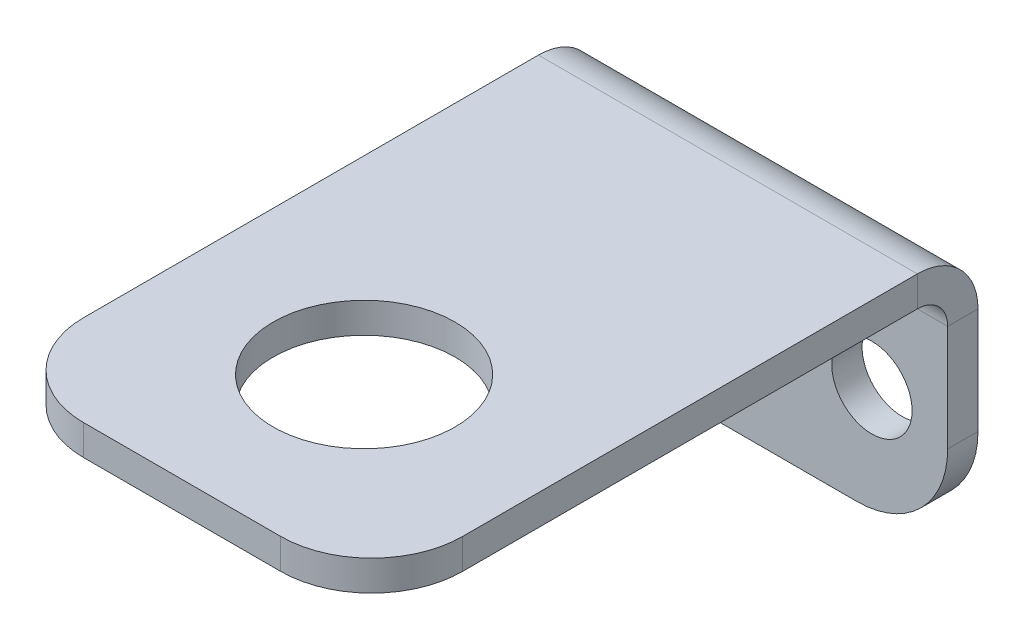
ISO-10303-21;
HEADER;
FILE_DESCRIPTION(('STEP AP214'),'2;1');
FILE_NAME('part.step','',(''),(''),'','','');
FILE_SCHEMA(('AUTOMOTIVE_DESIGN { 1 0 10303 214 1 1 1 1 }'));
ENDSEC;
DATA;
#1=APPLICATION_CONTEXT('core data for automotive mechanical design processes');
#2=APPLICATION_PROTOCOL_DEFINITION('international standard','automotive_design',2000,#1);
#3=PRODUCT_CONTEXT('',#1,'mechanical');
#4=PRODUCT('Part','Part','',(#3));
#5=PRODUCT_RELATED_PRODUCT_CATEGORY('part','',(#4));
#6=PRODUCT_DEFINITION_FORMATION('','',#4);
#7=PRODUCT_DEFINITION_CONTEXT('part definition',#1,'design');
#8=PRODUCT_DEFINITION('design','',#6,#7);
#9=PRODUCT_DEFINITION_SHAPE('','',#8);
#10=(LENGTH_UNIT() NAMED_UNIT(*) SI_UNIT(.MILLI.,.METRE.));
#11=(NAMED_UNIT(*) PLANE_ANGLE_UNIT() SI_UNIT($,.RADIAN.));
#12=(NAMED_UNIT(*) SI_UNIT($,.STERADIAN.) SOLID_ANGLE_UNIT());
#13=UNCERTAINTY_MEASURE_WITH_UNIT(LENGTH_MEASURE(1.E-05),#10,'distance_accuracy_value','');
#14=(GEOMETRIC_REPRESENTATION_CONTEXT(3) GLOBAL_UNCERTAINTY_ASSIGNED_CONTEXT((#13)) GLOBAL_UNIT_ASSIGNED_CONTEXT((#10,
#11,#12)) REPRESENTATION_CONTEXT('',''));
#15=CARTESIAN_POINT('',(0.,0.,0.));
#16=DIRECTION('',(0.,0.,1.));
#17=DIRECTION('',(1.,0.,0.));
#18=AXIS2_PLACEMENT_3D('',#15,#16,#17);
#19=CARTESIAN_POINT('',(0.,0.,2.));
#20=DIRECTION('',(1.,0.,0.));
#21=DIRECTION('',(0.,0.,-1.));
#22=AXIS2_PLACEMENT_3D('',#19,#20,#21);
#23=PLANE('',#22);
#24=DIRECTION('',(0.,-1.,0.));
#25=VECTOR('',#24,1.);
#26=CARTESIAN_POINT('',(0.,0.,0.));
#27=LINE('',#26,#25);
#28=CARTESIAN_POINT('',(0.,13.,0.));
#29=VERTEX_POINT('',#28);
#30=CARTESIAN_POINT('',(0.,6.,0.));
#31=VERTEX_POINT('',#30);
#32=EDGE_CURVE('E188',#29,#31,#27,.T.);
#33=ORIENTED_EDGE('',*,*,#32,.T.);
#34=DIRECTION('',(0.,0.,-1.));
#35=VECTOR('',#34,1.);
#36=CARTESIAN_POINT('',(0.,6.,2.));
#37=LINE('',#36,#35);
#38=CARTESIAN_POINT('',(0.,6.,2.));
#39=VERTEX_POINT('',#38);
#40=EDGE_CURVE('E57',#31,#39,#37,.F.);
#41=ORIENTED_EDGE('',*,*,#40,.T.);
#42=DIRECTION('',(0.,-1.,0.));
#43=VECTOR('',#42,1.);
#44=CARTESIAN_POINT('',(0.,0.,2.));
#45=LINE('',#44,#43);
#46=CARTESIAN_POINT('',(0.,13.,2.));
#47=VERTEX_POINT('',#46);
#48=EDGE_CURVE('E190',#47,#39,#45,.T.);
#49=ORIENTED_EDGE('',*,*,#48,.F.);
#50=DIRECTION('',(0.,0.,-1.));
#51=VECTOR('',#50,1.);
#52=CARTESIAN_POINT('',(0.,13.,2.));
#53=LINE('',#52,#51);
#54=EDGE_CURVE('E177',#47,#29,#53,.T.);
#55=ORIENTED_EDGE('',*,*,#54,.T.);
#56=EDGE_LOOP('',(#33,#41,#49,#55));
#57=FACE_BOUND('',#56,.T.);
#58=ADVANCED_FACE('F34',(#57),#23,.F.);
#59=CARTESIAN_POINT('',(25.,0.,2.));
#60=DIRECTION('',(-1.,0.,0.));
#61=DIRECTION('',(0.,-1.,0.));
#62=AXIS2_PLACEMENT_3D('',#59,#60,#61);
#63=PLANE('',#62);
#64=DIRECTION('',(0.,1.,0.));
#65=VECTOR('',#64,1.);
#66=CARTESIAN_POINT('',(25.,0.,2.));
#67=LINE('',#66,#65);
#68=CARTESIAN_POINT('',(25.,6.,2.));
#69=VERTEX_POINT('',#68);
#70=CARTESIAN_POINT('',(25.,13.,2.));
#71=VERTEX_POINT('',#70);
#72=EDGE_CURVE('E195',#69,#71,#67,.T.);
#73=ORIENTED_EDGE('',*,*,#72,.F.);
#74=DIRECTION('',(0.,0.,-1.));
#75=VECTOR('',#74,1.);
#76=CARTESIAN_POINT('',(25.,6.,2.));
#77=LINE('',#76,#75);
#78=CARTESIAN_POINT('',(25.,6.,0.));
#79=VERTEX_POINT('',#78);
#80=EDGE_CURVE('E11',#69,#79,#77,.T.);
#81=ORIENTED_EDGE('',*,*,#80,.T.);
#82=DIRECTION('',(0.,1.,0.));
#83=VECTOR('',#82,1.);
#84=CARTESIAN_POINT('',(25.,0.,0.));
#85=LINE('',#84,#83);
#86=CARTESIAN_POINT('',(25.,13.,0.));
#87=VERTEX_POINT('',#86);
#88=EDGE_CURVE('E193',#79,#87,#85,.T.);
#89=ORIENTED_EDGE('',*,*,#88,.T.);
#90=DIRECTION('',(0.,0.,-1.));
#91=VECTOR('',#90,1.);
#92=CARTESIAN_POINT('',(25.,13.,2.));
#93=LINE('',#92,#91);
#94=EDGE_CURVE('E185',#71,#87,#93,.T.);
#95=ORIENTED_EDGE('',*,*,#94,.F.);
#96=EDGE_LOOP('',(#73,#81,#89,#95));
#97=FACE_BOUND('',#96,.T.);
#98=ADVANCED_FACE('F250',(#97),#63,.F.);
#99=CARTESIAN_POINT('',(0.,15.,2.));
#100=DIRECTION('',(0.,0.,-1.));
#101=DIRECTION('',(-1.,0.,0.));
#102=AXIS2_PLACEMENT_3D('',#99,#100,#101);
#103=PLANE('',#102);
#104=CARTESIAN_POINT('',(20.,7.,2.));
#105=DIRECTION('',(0.,0.,1.));
#106=DIRECTION('',(1.,0.,0.));
#107=AXIS2_PLACEMENT_3D('',#104,#105,#106);
#108=CIRCLE('',#107,2.65);
#109=CARTESIAN_POINT('',(22.65,7.,2.));
#110=VERTEX_POINT('',#109);
#111=EDGE_CURVE('E278',#110,#110,#108,.T.);
#112=ORIENTED_EDGE('',*,*,#111,.F.);
#113=EDGE_LOOP('',(#112));
#114=FACE_BOUND('',#113,.T.);
#115=CARTESIAN_POINT('',(5.,7.,2.));
#116=DIRECTION('',(0.,0.,1.));
#117=DIRECTION('',(1.,0.,0.));
#118=AXIS2_PLACEMENT_3D('',#115,#116,#117);
#119=CIRCLE('',#118,2.65);
#120=CARTESIAN_POINT('',(7.65,7.,2.));
#121=VERTEX_POINT('',#120);
#122=EDGE_CURVE('E272',#121,#121,#119,.T.);
#123=ORIENTED_EDGE('',*,*,#122,.F.);
#124=EDGE_LOOP('',(#123));
#125=FACE_BOUND('',#124,.T.);
#126=ORIENTED_EDGE('',*,*,#48,.T.);
#127=CARTESIAN_POINT('',(6.,6.,2.));
#128=DIRECTION('',(0.,0.,-1.));
#129=DIRECTION('',(-1.,0.,0.));
#130=AXIS2_PLACEMENT_3D('',#127,#128,#129);
#131=CIRCLE('',#130,6.);
#132=CARTESIAN_POINT('',(6.,0.,2.));
#133=VERTEX_POINT('',#132);
#134=EDGE_CURVE('E42',#39,#133,#131,.F.);
#135=ORIENTED_EDGE('',*,*,#134,.T.);
#136=DIRECTION('',(1.,0.,0.));
#137=VECTOR('',#136,1.);
#138=CARTESIAN_POINT('',(0.,0.,2.));
#139=LINE('',#138,#137);
#140=CARTESIAN_POINT('',(19.,0.,2.));
#141=VERTEX_POINT('',#140);
#142=EDGE_CURVE('E192',#133,#141,#139,.T.);
#143=ORIENTED_EDGE('',*,*,#142,.T.);
#144=CARTESIAN_POINT('',(19.,6.,2.));
#145=DIRECTION('',(0.,0.,-1.));
#146=DIRECTION('',(-1.,0.,0.));
#147=AXIS2_PLACEMENT_3D('',#144,#145,#146);
#148=CIRCLE('',#147,6.);
#149=EDGE_CURVE('E49',#141,#69,#148,.F.);
#150=ORIENTED_EDGE('',*,*,#149,.T.);
#151=ORIENTED_EDGE('',*,*,#72,.T.);
#152=DIRECTION('',(-1.,0.,0.));
#153=VECTOR('',#152,1.);
#154=CARTESIAN_POINT('',(0.,13.,2.));
#155=LINE('',#154,#153);
#156=EDGE_CURVE('E181',#47,#71,#155,.F.);
#157=ORIENTED_EDGE('',*,*,#156,.F.);
#158=EDGE_LOOP('',(#126,#135,#143,#150,#151,#157));
#159=FACE_BOUND('',#158,.T.);
#160=ADVANCED_FACE('F231',(#114,#125,#159),#103,.F.);
#161=CARTESIAN_POINT('',(0.,15.,0.));
#162=DIRECTION('',(0.,0.,-1.));
#163=DIRECTION('',(-1.,0.,0.));
#164=AXIS2_PLACEMENT_3D('',#161,#162,#163);
#165=PLANE('',#164);
#166=CARTESIAN_POINT('',(20.,7.,0.));
#167=DIRECTION('',(0.,0.,1.));
#168=DIRECTION('',(1.,0.,0.));
#169=AXIS2_PLACEMENT_3D('',#166,#167,#168);
#170=CIRCLE('',#169,2.65);
#171=CARTESIAN_POINT('',(22.65,7.,0.));
#172=VERTEX_POINT('',#171);
#173=EDGE_CURVE('E275',#172,#172,#170,.T.);
#174=ORIENTED_EDGE('',*,*,#173,.T.);
#175=EDGE_LOOP('',(#174));
#176=FACE_BOUND('',#175,.T.);
#177=CARTESIAN_POINT('',(5.,7.,0.));
#178=DIRECTION('',(0.,0.,1.));
#179=DIRECTION('',(1.,0.,0.));
#180=AXIS2_PLACEMENT_3D('',#177,#178,#179);
#181=CIRCLE('',#180,2.65);
#182=CARTESIAN_POINT('',(7.65,7.,0.));
#183=VERTEX_POINT('',#182);
#184=EDGE_CURVE('E269',#183,#183,#181,.T.);
#185=ORIENTED_EDGE('',*,*,#184,.T.);
#186=EDGE_LOOP('',(#185));
#187=FACE_BOUND('',#186,.T.);
#188=DIRECTION('',(1.,0.,0.));
#189=VECTOR('',#188,1.);
#190=CARTESIAN_POINT('',(0.,0.,0.));
#191=LINE('',#190,#189);
#192=CARTESIAN_POINT('',(6.,0.,0.));
#193=VERTEX_POINT('',#192);
#194=CARTESIAN_POINT('',(19.,0.,0.));
#195=VERTEX_POINT('',#194);
#196=EDGE_CURVE('E199',#193,#195,#191,.T.);
#197=ORIENTED_EDGE('',*,*,#196,.F.);
#198=CARTESIAN_POINT('',(6.,6.,0.));
#199=DIRECTION('',(0.,0.,-1.));
#200=DIRECTION('',(-1.,0.,0.));
#201=AXIS2_PLACEMENT_3D('',#198,#199,#200);
#202=CIRCLE('',#201,6.);
#203=EDGE_CURVE('E226',#193,#31,#202,.T.);
#204=ORIENTED_EDGE('',*,*,#203,.T.);
#205=ORIENTED_EDGE('',*,*,#32,.F.);
#206=DIRECTION('',(-1.,0.,0.));
#207=VECTOR('',#206,1.);
#208=CARTESIAN_POINT('',(0.,13.,0.));
#209=LINE('',#208,#207);
#210=EDGE_CURVE('E134',#29,#87,#209,.F.);
#211=ORIENTED_EDGE('',*,*,#210,.T.);
#212=ORIENTED_EDGE('',*,*,#88,.F.);
#213=CARTESIAN_POINT('',(19.,6.,0.));
#214=DIRECTION('',(0.,0.,-1.));
#215=DIRECTION('',(-1.,0.,0.));
#216=AXIS2_PLACEMENT_3D('',#213,#214,#215);
#217=CIRCLE('',#216,6.);
#218=EDGE_CURVE('E224',#79,#195,#217,.T.);
#219=ORIENTED_EDGE('',*,*,#218,.T.);
#220=EDGE_LOOP('',(#197,#204,#205,#211,#212,#219));
#221=FACE_BOUND('',#220,.T.);
#222=ADVANCED_FACE('F242',(#176,#187,#221),#165,.T.);
#223=CARTESIAN_POINT('',(0.,0.,2.));
#224=DIRECTION('',(0.,1.,0.));
#225=DIRECTION('',(0.,0.,1.));
#226=AXIS2_PLACEMENT_3D('',#223,#224,#225);
#227=PLANE('',#226);
#228=ORIENTED_EDGE('',*,*,#142,.F.);
#229=DIRECTION('',(0.,0.,-1.));
#230=VECTOR('',#229,1.);
#231=CARTESIAN_POINT('',(6.,0.,2.));
#232=LINE('',#231,#230);
#233=EDGE_CURVE('E221',#133,#193,#232,.T.);
#234=ORIENTED_EDGE('',*,*,#233,.T.);
#235=ORIENTED_EDGE('',*,*,#196,.T.);
#236=DIRECTION('',(0.,0.,-1.));
#237=VECTOR('',#236,1.);
#238=CARTESIAN_POINT('',(19.,0.,2.));
#239=LINE('',#238,#237);
#240=EDGE_CURVE('E219',#195,#141,#239,.F.);
#241=ORIENTED_EDGE('',*,*,#240,.T.);
#242=EDGE_LOOP('',(#228,#234,#235,#241));
#243=FACE_BOUND('',#242,.T.);
#244=ADVANCED_FACE('F236',(#243),#227,.F.);
#245=CARTESIAN_POINT('',(25.,13.,4.));
#246=DIRECTION('',(1.,0.,0.));
#247=DIRECTION('',(0.,0.,-1.));
#248=AXIS2_PLACEMENT_3D('',#245,#246,#247);
#249=PLANE('',#248);
#250=DIRECTION('',(0.,1.,0.));
#251=VECTOR('',#250,1.);
#252=CARTESIAN_POINT('',(25.,15.,3.99999999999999));
#253=LINE('',#252,#251);
#254=CARTESIAN_POINT('',(25.,15.,3.99999999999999));
#255=VERTEX_POINT('',#254);
#256=CARTESIAN_POINT('',(25.,17.,3.99999999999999));
#257=VERTEX_POINT('',#256);
#258=EDGE_CURVE('E257',#255,#257,#253,.T.);
#259=ORIENTED_EDGE('',*,*,#258,.F.);
#260=CARTESIAN_POINT('',(25.,13.,4.));
#261=DIRECTION('',(-1.,0.,0.));
#262=DIRECTION('',(0.,0.,1.));
#263=AXIS2_PLACEMENT_3D('',#260,#261,#262);
#264=CIRCLE('',#263,2.);
#265=EDGE_CURVE('E137',#71,#255,#264,.F.);
#266=ORIENTED_EDGE('',*,*,#265,.F.);
#267=ORIENTED_EDGE('',*,*,#94,.T.);
#268=CARTESIAN_POINT('',(25.,13.,4.));
#269=DIRECTION('',(-1.,0.,0.));
#270=DIRECTION('',(0.,0.,1.));
#271=AXIS2_PLACEMENT_3D('',#268,#269,#270);
#272=CIRCLE('',#271,4.);
#273=EDGE_CURVE('E176',#87,#257,#272,.F.);
#274=ORIENTED_EDGE('',*,*,#273,.T.);
#275=EDGE_LOOP('',(#259,#266,#267,#274));
#276=FACE_BOUND('',#275,.T.);
#277=ADVANCED_FACE('F256',(#276),#249,.T.);
#278=CARTESIAN_POINT('',(0.,13.,4.));
#279=DIRECTION('',(1.,0.,0.));
#280=DIRECTION('',(0.,0.,-1.));
#281=AXIS2_PLACEMENT_3D('',#278,#279,#280);
#282=PLANE('',#281);
#283=CARTESIAN_POINT('',(0.,13.,4.));
#284=DIRECTION('',(-1.,0.,0.));
#285=DIRECTION('',(0.,0.,1.));
#286=AXIS2_PLACEMENT_3D('',#283,#284,#285);
#287=CIRCLE('',#286,2.);
#288=CARTESIAN_POINT('',(0.,15.,3.99999999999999));
#289=VERTEX_POINT('',#288);
#290=EDGE_CURVE('E144',#289,#47,#287,.T.);
#291=ORIENTED_EDGE('',*,*,#290,.F.);
#292=DIRECTION('',(0.,1.,0.));
#293=VECTOR('',#292,1.);
#294=CARTESIAN_POINT('',(0.,15.,3.99999999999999));
#295=LINE('',#294,#293);
#296=CARTESIAN_POINT('',(0.,17.,3.99999999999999));
#297=VERTEX_POINT('',#296);
#298=EDGE_CURVE('E141',#289,#297,#295,.T.);
#299=ORIENTED_EDGE('',*,*,#298,.T.);
#300=CARTESIAN_POINT('',(0.,13.,4.));
#301=DIRECTION('',(-1.,0.,0.));
#302=DIRECTION('',(0.,0.,1.));
#303=AXIS2_PLACEMENT_3D('',#300,#301,#302);
#304=CIRCLE('',#303,4.);
#305=EDGE_CURVE('E126',#297,#29,#304,.T.);
#306=ORIENTED_EDGE('',*,*,#305,.T.);
#307=ORIENTED_EDGE('',*,*,#54,.F.);
#308=EDGE_LOOP('',(#291,#299,#306,#307));
#309=FACE_BOUND('',#308,.T.);
#310=ADVANCED_FACE('F142',(#309),#282,.F.);
#311=CARTESIAN_POINT('',(0.,13.,4.));
#312=DIRECTION('',(-1.,0.,0.));
#313=DIRECTION('',(0.,1.,0.));
#314=AXIS2_PLACEMENT_3D('',#311,#312,#313);
#315=CYLINDRICAL_SURFACE('',#314,4.);
#316=ORIENTED_EDGE('',*,*,#210,.F.);
#317=ORIENTED_EDGE('',*,*,#305,.F.);
#318=DIRECTION('',(1.,0.,0.));
#319=VECTOR('',#318,1.);
#320=CARTESIAN_POINT('',(25.,17.,3.99999999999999));
#321=LINE('',#320,#319);
#322=EDGE_CURVE('E131',#297,#257,#321,.T.);
#323=ORIENTED_EDGE('',*,*,#322,.T.);
#324=ORIENTED_EDGE('',*,*,#273,.F.);
#325=EDGE_LOOP('',(#316,#317,#323,#324));
#326=FACE_BOUND('',#325,.T.);
#327=ADVANCED_FACE('F128',(#326),#315,.T.);
#328=CARTESIAN_POINT('',(0.,13.,4.));
#329=DIRECTION('',(-1.,0.,0.));
#330=DIRECTION('',(0.,1.,0.));
#331=AXIS2_PLACEMENT_3D('',#328,#329,#330);
#332=CYLINDRICAL_SURFACE('',#331,2.);
#333=ORIENTED_EDGE('',*,*,#156,.T.);
#334=ORIENTED_EDGE('',*,*,#265,.T.);
#335=DIRECTION('',(-1.,0.,0.));
#336=VECTOR('',#335,1.);
#337=CARTESIAN_POINT('',(25.,15.,3.99999999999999));
#338=LINE('',#337,#336);
#339=EDGE_CURVE('E149',#255,#289,#338,.T.);
#340=ORIENTED_EDGE('',*,*,#339,.T.);
#341=ORIENTED_EDGE('',*,*,#290,.T.);
#342=EDGE_LOOP('',(#333,#334,#340,#341));
#343=FACE_BOUND('',#342,.T.);
#344=ADVANCED_FACE('F244',(#343),#332,.F.);
#345=CARTESIAN_POINT('',(25.,17.,1.99999999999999));
#346=DIRECTION('',(-1.,0.,0.));
#347=DIRECTION('',(0.,0.,1.));
#348=AXIS2_PLACEMENT_3D('',#345,#346,#347);
#349=PLANE('',#348);
#350=DIRECTION('',(0.,0.,-1.));
#351=VECTOR('',#350,1.);
#352=CARTESIAN_POINT('',(25.,17.,1.99999999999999));
#353=LINE('',#352,#351);
#354=CARTESIAN_POINT('',(25.,17.0000000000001,34.));
#355=VERTEX_POINT('',#354);
#356=EDGE_CURVE('E157',#355,#257,#353,.T.);
#357=ORIENTED_EDGE('',*,*,#356,.F.);
#358=DIRECTION('',(0.,-1.,0.));
#359=VECTOR('',#358,1.);
#360=CARTESIAN_POINT('',(25.,17.0000000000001,34.));
#361=LINE('',#360,#359);
#362=CARTESIAN_POINT('',(25.,15.0000000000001,34.));
#363=VERTEX_POINT('',#362);
#364=EDGE_CURVE('E216',#355,#363,#361,.T.);
#365=ORIENTED_EDGE('',*,*,#364,.T.);
#366=DIRECTION('',(0.,0.,-1.));
#367=VECTOR('',#366,1.);
#368=CARTESIAN_POINT('',(25.,15.,2.));
#369=LINE('',#368,#367);
#370=EDGE_CURVE('E158',#363,#255,#369,.T.);
#371=ORIENTED_EDGE('',*,*,#370,.T.);
#372=ORIENTED_EDGE('',*,*,#258,.T.);
#373=EDGE_LOOP('',(#357,#365,#371,#372));
#374=FACE_BOUND('',#373,.T.);
#375=ADVANCED_FACE('F421',(#374),#349,.F.);
#376=CARTESIAN_POINT('',(0.,17.0000000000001,40.));
#377=DIRECTION('',(1.,0.,0.));
#378=DIRECTION('',(0.,0.,-1.));
#379=AXIS2_PLACEMENT_3D('',#376,#377,#378);
#380=PLANE('',#379);
#381=DIRECTION('',(0.,0.,1.));
#382=VECTOR('',#381,1.);
#383=CARTESIAN_POINT('',(0.,15.0000000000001,40.));
#384=LINE('',#383,#382);
#385=CARTESIAN_POINT('',(0.,15.0000000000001,34.));
#386=VERTEX_POINT('',#385);
#387=EDGE_CURVE('E171',#289,#386,#384,.T.);
#388=ORIENTED_EDGE('',*,*,#387,.T.);
#389=DIRECTION('',(0.,-1.,0.));
#390=VECTOR('',#389,1.);
#391=CARTESIAN_POINT('',(0.,17.0000000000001,34.));
#392=LINE('',#391,#390);
#393=CARTESIAN_POINT('',(0.,17.0000000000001,34.));
#394=VERTEX_POINT('',#393);
#395=EDGE_CURVE('E162',#386,#394,#392,.F.);
#396=ORIENTED_EDGE('',*,*,#395,.T.);
#397=DIRECTION('',(0.,0.,1.));
#398=VECTOR('',#397,1.);
#399=CARTESIAN_POINT('',(0.,17.0000000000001,40.));
#400=LINE('',#399,#398);
#401=EDGE_CURVE('E154',#297,#394,#400,.T.);
#402=ORIENTED_EDGE('',*,*,#401,.F.);
#403=ORIENTED_EDGE('',*,*,#298,.F.);
#404=EDGE_LOOP('',(#388,#396,#402,#403));
#405=FACE_BOUND('',#404,.T.);
#406=ADVANCED_FACE('F160',(#405),#380,.F.);
#407=CARTESIAN_POINT('',(25.,17.0000000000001,40.));
#408=DIRECTION('',(0.,-1.,0.));
#409=DIRECTION('',(0.,0.,-1.));
#410=AXIS2_PLACEMENT_3D('',#407,#408,#409);
#411=PLANE('',#410);
#412=CARTESIAN_POINT('',(12.5,17.0000000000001,28.));
#413=DIRECTION('',(0.,-1.,0.));
#414=DIRECTION('',(0.,0.,-1.));
#415=AXIS2_PLACEMENT_3D('',#412,#413,#414);
#416=CIRCLE('',#415,6.);
#417=CARTESIAN_POINT('',(12.5,17.0000000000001,22.));
#418=VERTEX_POINT('',#417);
#419=EDGE_CURVE('E263',#418,#418,#416,.T.);
#420=ORIENTED_EDGE('',*,*,#419,.T.);
#421=EDGE_LOOP('',(#420));
#422=FACE_BOUND('',#421,.T.);
#423=ORIENTED_EDGE('',*,*,#401,.T.);
#424=CARTESIAN_POINT('',(6.00000000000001,17.0000000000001,34.));
#425=DIRECTION('',(0.,-1.,0.));
#426=DIRECTION('',(0.,0.,-1.));
#427=AXIS2_PLACEMENT_3D('',#424,#425,#426);
#428=CIRCLE('',#427,6.);
#429=CARTESIAN_POINT('',(6.00000000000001,17.0000000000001,40.));
#430=VERTEX_POINT('',#429);
#431=EDGE_CURVE('E214',#394,#430,#428,.F.);
#432=ORIENTED_EDGE('',*,*,#431,.T.);
#433=DIRECTION('',(1.,0.,0.));
#434=VECTOR('',#433,1.);
#435=CARTESIAN_POINT('',(25.,17.0000000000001,40.));
#436=LINE('',#435,#434);
#437=CARTESIAN_POINT('',(19.,17.0000000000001,40.));
#438=VERTEX_POINT('',#437);
#439=EDGE_CURVE('E163',#430,#438,#436,.T.);
#440=ORIENTED_EDGE('',*,*,#439,.T.);
#441=CARTESIAN_POINT('',(19.,17.0000000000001,34.));
#442=DIRECTION('',(0.,-1.,0.));
#443=DIRECTION('',(0.,0.,-1.));
#444=AXIS2_PLACEMENT_3D('',#441,#442,#443);
#445=CIRCLE('',#444,6.);
#446=EDGE_CURVE('E212',#438,#355,#445,.F.);
#447=ORIENTED_EDGE('',*,*,#446,.T.);
#448=ORIENTED_EDGE('',*,*,#356,.T.);
#449=ORIENTED_EDGE('',*,*,#322,.F.);
#450=EDGE_LOOP('',(#423,#432,#440,#447,#448,#449));
#451=FACE_BOUND('',#450,.T.);
#452=ADVANCED_FACE('F153',(#422,#451),#411,.F.);
#453=CARTESIAN_POINT('',(25.,15.0000000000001,40.));
#454=DIRECTION('',(0.,-1.,0.));
#455=DIRECTION('',(0.,0.,-1.));
#456=AXIS2_PLACEMENT_3D('',#453,#454,#455);
#457=PLANE('',#456);
#458=CARTESIAN_POINT('',(12.5,15.0000000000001,28.));
#459=DIRECTION('',(0.,-1.,0.));
#460=DIRECTION('',(0.,0.,-1.));
#461=AXIS2_PLACEMENT_3D('',#458,#459,#460);
#462=CIRCLE('',#461,6.);
#463=CARTESIAN_POINT('',(12.5,15.0000000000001,22.));
#464=VERTEX_POINT('',#463);
#465=EDGE_CURVE('E266',#464,#464,#462,.T.);
#466=ORIENTED_EDGE('',*,*,#465,.F.);
#467=EDGE_LOOP('',(#466));
#468=FACE_BOUND('',#467,.T.);
#469=DIRECTION('',(1.,0.,0.));
#470=VECTOR('',#469,1.);
#471=CARTESIAN_POINT('',(25.,15.0000000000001,40.));
#472=LINE('',#471,#470);
#473=CARTESIAN_POINT('',(6.00000000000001,15.0000000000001,40.));
#474=VERTEX_POINT('',#473);
#475=CARTESIAN_POINT('',(19.,15.0000000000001,40.));
#476=VERTEX_POINT('',#475);
#477=EDGE_CURVE('E167',#474,#476,#472,.T.);
#478=ORIENTED_EDGE('',*,*,#477,.F.);
#479=CARTESIAN_POINT('',(6.00000000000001,15.0000000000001,34.));
#480=DIRECTION('',(0.,-1.,0.));
#481=DIRECTION('',(0.,0.,-1.));
#482=AXIS2_PLACEMENT_3D('',#479,#480,#481);
#483=CIRCLE('',#482,6.);
#484=EDGE_CURVE('E209',#474,#386,#483,.T.);
#485=ORIENTED_EDGE('',*,*,#484,.T.);
#486=ORIENTED_EDGE('',*,*,#387,.F.);
#487=ORIENTED_EDGE('',*,*,#339,.F.);
#488=ORIENTED_EDGE('',*,*,#370,.F.);
#489=CARTESIAN_POINT('',(19.,15.0000000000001,34.));
#490=DIRECTION('',(0.,-1.,0.));
#491=DIRECTION('',(0.,0.,-1.));
#492=AXIS2_PLACEMENT_3D('',#489,#490,#491);
#493=CIRCLE('',#492,6.);
#494=EDGE_CURVE('E207',#363,#476,#493,.T.);
#495=ORIENTED_EDGE('',*,*,#494,.T.);
#496=EDGE_LOOP('',(#478,#485,#486,#487,#488,#495));
#497=FACE_BOUND('',#496,.T.);
#498=ADVANCED_FACE('F261',(#468,#497),#457,.T.);
#499=CARTESIAN_POINT('',(25.,17.0000000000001,40.));
#500=DIRECTION('',(0.,0.,-1.));
#501=DIRECTION('',(0.,1.,0.));
#502=AXIS2_PLACEMENT_3D('',#499,#500,#501);
#503=PLANE('',#502);
#504=ORIENTED_EDGE('',*,*,#439,.F.);
#505=DIRECTION('',(0.,-1.,0.));
#506=VECTOR('',#505,1.);
#507=CARTESIAN_POINT('',(6.00000000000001,17.0000000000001,40.));
#508=LINE('',#507,#506);
#509=EDGE_CURVE('E204',#430,#474,#508,.T.);
#510=ORIENTED_EDGE('',*,*,#509,.T.);
#511=ORIENTED_EDGE('',*,*,#477,.T.);
#512=DIRECTION('',(0.,-1.,0.));
#513=VECTOR('',#512,1.);
#514=CARTESIAN_POINT('',(19.,17.0000000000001,40.));
#515=LINE('',#514,#513);
#516=EDGE_CURVE('E197',#476,#438,#515,.F.);
#517=ORIENTED_EDGE('',*,*,#516,.T.);
#518=EDGE_LOOP('',(#504,#510,#511,#517));
#519=FACE_BOUND('',#518,.T.);
#520=ADVANCED_FACE('F306',(#519),#503,.F.);
#521=CARTESIAN_POINT('',(12.5,17.0000000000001,28.));
#522=DIRECTION('',(0.,-1.,0.));
#523=DIRECTION('',(0.,0.,-1.));
#524=AXIS2_PLACEMENT_3D('',#521,#522,#523);
#525=CYLINDRICAL_SURFACE('',#524,6.);
#526=ORIENTED_EDGE('',*,*,#419,.F.);
#527=EDGE_LOOP('',(#526));
#528=FACE_BOUND('',#527,.T.);
#529=ORIENTED_EDGE('',*,*,#465,.T.);
#530=EDGE_LOOP('',(#529));
#531=FACE_BOUND('',#530,.T.);
#532=ADVANCED_FACE('F300',(#528,#531),#525,.F.);
#533=CARTESIAN_POINT('',(5.,7.,0.));
#534=DIRECTION('',(0.,0.,1.));
#535=DIRECTION('',(1.,0.,0.));
#536=AXIS2_PLACEMENT_3D('',#533,#534,#535);
#537=CYLINDRICAL_SURFACE('',#536,2.65);
#538=ORIENTED_EDGE('',*,*,#184,.F.);
#539=EDGE_LOOP('',(#538));
#540=FACE_BOUND('',#539,.T.);
#541=ORIENTED_EDGE('',*,*,#122,.T.);
#542=EDGE_LOOP('',(#541));
#543=FACE_BOUND('',#542,.T.);
#544=ADVANCED_FACE('F290',(#540,#543),#537,.F.);
#545=CARTESIAN_POINT('',(20.,7.,0.));
#546=DIRECTION('',(0.,0.,1.));
#547=DIRECTION('',(1.,0.,0.));
#548=AXIS2_PLACEMENT_3D('',#545,#546,#547);
#549=CYLINDRICAL_SURFACE('',#548,2.65);
#550=ORIENTED_EDGE('',*,*,#173,.F.);
#551=EDGE_LOOP('',(#550));
#552=FACE_BOUND('',#551,.T.);
#553=ORIENTED_EDGE('',*,*,#111,.T.);
#554=EDGE_LOOP('',(#553));
#555=FACE_BOUND('',#554,.T.);
#556=ADVANCED_FACE('F286',(#552,#555),#549,.F.);
#557=CARTESIAN_POINT('',(6.00000000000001,17.0000000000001,34.));
#558=DIRECTION('',(0.,-1.,0.));
#559=DIRECTION('',(0.,0.,-1.));
#560=AXIS2_PLACEMENT_3D('',#557,#558,#559);
#561=CYLINDRICAL_SURFACE('',#560,6.);
#562=ORIENTED_EDGE('',*,*,#431,.F.);
#563=ORIENTED_EDGE('',*,*,#395,.F.);
#564=ORIENTED_EDGE('',*,*,#484,.F.);
#565=ORIENTED_EDGE('',*,*,#509,.F.);
#566=EDGE_LOOP('',(#562,#563,#564,#565));
#567=FACE_BOUND('',#566,.T.);
#568=ADVANCED_FACE('F289',(#567),#561,.T.);
#569=CARTESIAN_POINT('',(19.,17.0000000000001,34.));
#570=DIRECTION('',(0.,-1.,0.));
#571=DIRECTION('',(0.,0.,-1.));
#572=AXIS2_PLACEMENT_3D('',#569,#570,#571);
#573=CYLINDRICAL_SURFACE('',#572,6.);
#574=ORIENTED_EDGE('',*,*,#446,.F.);
#575=ORIENTED_EDGE('',*,*,#516,.F.);
#576=ORIENTED_EDGE('',*,*,#494,.F.);
#577=ORIENTED_EDGE('',*,*,#364,.F.);
#578=EDGE_LOOP('',(#574,#575,#576,#577));
#579=FACE_BOUND('',#578,.T.);
#580=ADVANCED_FACE('F320',(#579),#573,.T.);
#581=CARTESIAN_POINT('',(6.,6.,2.));
#582=DIRECTION('',(0.,0.,-1.));
#583=DIRECTION('',(-1.,0.,0.));
#584=AXIS2_PLACEMENT_3D('',#581,#582,#583);
#585=CYLINDRICAL_SURFACE('',#584,6.);
#586=ORIENTED_EDGE('',*,*,#134,.F.);
#587=ORIENTED_EDGE('',*,*,#40,.F.);
#588=ORIENTED_EDGE('',*,*,#203,.F.);
#589=ORIENTED_EDGE('',*,*,#233,.F.);
#590=EDGE_LOOP('',(#586,#587,#588,#589));
#591=FACE_BOUND('',#590,.T.);
#592=ADVANCED_FACE('F239',(#591),#585,.T.);
#593=CARTESIAN_POINT('',(19.,6.,2.));
#594=DIRECTION('',(0.,0.,-1.));
#595=DIRECTION('',(-1.,0.,0.));
#596=AXIS2_PLACEMENT_3D('',#593,#594,#595);
#597=CYLINDRICAL_SURFACE('',#596,6.);
#598=ORIENTED_EDGE('',*,*,#149,.F.);
#599=ORIENTED_EDGE('',*,*,#240,.F.);
#600=ORIENTED_EDGE('',*,*,#218,.F.);
#601=ORIENTED_EDGE('',*,*,#80,.F.);
#602=EDGE_LOOP('',(#598,#599,#600,#601));
#603=FACE_BOUND('',#602,.T.);
#604=ADVANCED_FACE('F36',(#603),#597,.T.);
#605=CLOSED_SHELL('',(#58,#98,#160,#222,#244,#277,#310,#327,#344,#375,#406,#452,#498,#520,#532,
#544,#556,#568,#580,#592,#604));
#606=MANIFOLD_SOLID_BREP('B2',#605);
#607=ADVANCED_BREP_SHAPE_REPRESENTATION('',(#18,#606),#14);
#608=SHAPE_DEFINITION_REPRESENTATION(#9,#607);
ENDSEC;
END-ISO-10303-21;
